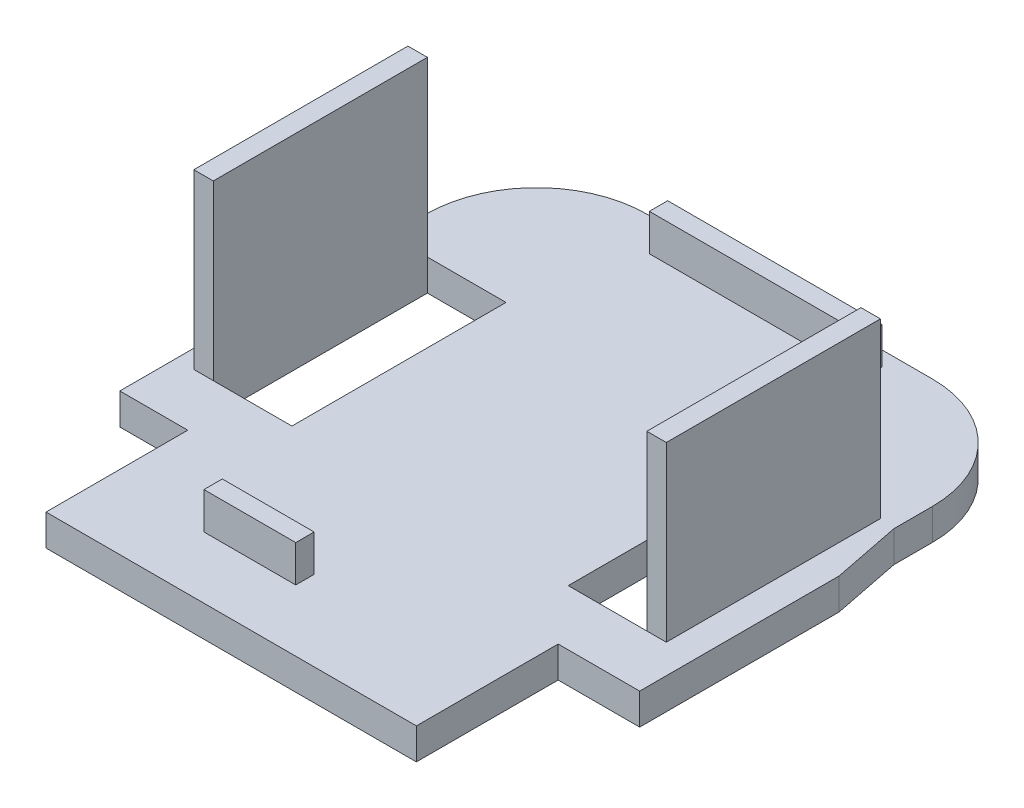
ISO-10303-21;
HEADER;
FILE_DESCRIPTION(('STEP AP214'),'2;1');
FILE_NAME('part.step','',(''),(''),'','','');
FILE_SCHEMA(('AUTOMOTIVE_DESIGN { 1 0 10303 214 1 1 1 1 }'));
ENDSEC;
DATA;
#1=APPLICATION_CONTEXT('core data for automotive mechanical design processes');
#2=APPLICATION_PROTOCOL_DEFINITION('international standard','automotive_design',2000,#1);
#3=PRODUCT_CONTEXT('',#1,'mechanical');
#4=PRODUCT('Part','Part','',(#3));
#5=PRODUCT_RELATED_PRODUCT_CATEGORY('part','',(#4));
#6=PRODUCT_DEFINITION_FORMATION('','',#4);
#7=PRODUCT_DEFINITION_CONTEXT('part definition',#1,'design');
#8=PRODUCT_DEFINITION('design','',#6,#7);
#9=PRODUCT_DEFINITION_SHAPE('','',#8);
#10=(LENGTH_UNIT() NAMED_UNIT(*) SI_UNIT(.MILLI.,.METRE.));
#11=(NAMED_UNIT(*) PLANE_ANGLE_UNIT() SI_UNIT($,.RADIAN.));
#12=(NAMED_UNIT(*) SI_UNIT($,.STERADIAN.) SOLID_ANGLE_UNIT());
#13=UNCERTAINTY_MEASURE_WITH_UNIT(LENGTH_MEASURE(1.E-05),#10,'distance_accuracy_value','');
#14=(GEOMETRIC_REPRESENTATION_CONTEXT(3) GLOBAL_UNCERTAINTY_ASSIGNED_CONTEXT((#13)) GLOBAL_UNIT_ASSIGNED_CONTEXT((#10,
#11,#12)) REPRESENTATION_CONTEXT('',''));
#15=CARTESIAN_POINT('',(0.,0.,0.));
#16=DIRECTION('',(0.,0.,1.));
#17=DIRECTION('',(1.,0.,0.));
#18=AXIS2_PLACEMENT_3D('',#15,#16,#17);
#19=CARTESIAN_POINT('',(22.6949,2.159,-31.0007));
#20=DIRECTION('',(0.,1.,0.));
#21=DIRECTION('',(0.,0.,1.));
#22=AXIS2_PLACEMENT_3D('',#19,#20,#21);
#23=PLANE('',#22);
#24=DIRECTION('',(1.,0.,0.));
#25=VECTOR('',#24,1.);
#26=CARTESIAN_POINT('',(27.9019,2.159,-13.6525));
#27=LINE('',#26,#25);
#28=CARTESIAN_POINT('',(22.4663,2.159,-13.6525));
#29=VERTEX_POINT('',#28);
#30=CARTESIAN_POINT('',(27.9019,2.159,-13.6525));
#31=VERTEX_POINT('',#30);
#32=EDGE_CURVE('E278',#29,#31,#27,.T.);
#33=ORIENTED_EDGE('',*,*,#32,.F.);
#34=DIRECTION('',(0.,0.,1.));
#35=VECTOR('',#34,1.);
#36=CARTESIAN_POINT('',(22.4663,2.159,-28.4607));
#37=LINE('',#36,#35);
#38=CARTESIAN_POINT('',(22.4663,2.159,-28.4607));
#39=VERTEX_POINT('',#38);
#40=EDGE_CURVE('E280',#39,#29,#37,.T.);
#41=ORIENTED_EDGE('',*,*,#40,.F.);
#42=DIRECTION('',(-1.,0.,0.));
#43=VECTOR('',#42,1.);
#44=CARTESIAN_POINT('',(27.9019,2.159,-28.4607));
#45=LINE('',#44,#43);
#46=CARTESIAN_POINT('',(27.9019,2.159,-28.4607));
#47=VERTEX_POINT('',#46);
#48=EDGE_CURVE('E285',#47,#39,#45,.T.);
#49=ORIENTED_EDGE('',*,*,#48,.F.);
#50=DIRECTION('',(-1.,0.,0.));
#51=VECTOR('',#50,1.);
#52=CARTESIAN_POINT('',(27.9019,2.159,-28.4607));
#53=LINE('',#52,#51);
#54=CARTESIAN_POINT('',(29.2481,2.159,-28.4607));
#55=VERTEX_POINT('',#54);
#56=EDGE_CURVE('E326',#55,#47,#53,.T.);
#57=ORIENTED_EDGE('',*,*,#56,.F.);
#58=DIRECTION('',(0.,0.,-1.));
#59=VECTOR('',#58,1.);
#60=CARTESIAN_POINT('',(29.2481,2.159,-13.6525));
#61=LINE('',#60,#59);
#62=CARTESIAN_POINT('',(29.2481,2.159,-13.6525));
#63=VERTEX_POINT('',#62);
#64=EDGE_CURVE('E333',#63,#55,#61,.T.);
#65=ORIENTED_EDGE('',*,*,#64,.F.);
#66=DIRECTION('',(1.,0.,0.));
#67=VECTOR('',#66,1.);
#68=CARTESIAN_POINT('',(27.9019,2.159,-13.6525));
#69=LINE('',#68,#67);
#70=EDGE_CURVE('E316',#31,#63,#69,.T.);
#71=ORIENTED_EDGE('',*,*,#70,.F.);
#72=EDGE_LOOP('',(#33,#41,#49,#57,#65,#71));
#73=FACE_BOUND('',#72,.T.);
#74=DIRECTION('',(-1.,0.,0.));
#75=VECTOR('',#74,1.);
#76=CARTESIAN_POINT('',(-2.0828,2.159,-28.4607));
#77=LINE('',#76,#75);
#78=CARTESIAN_POINT('',(3.3528,2.159,-28.4607));
#79=VERTEX_POINT('',#78);
#80=CARTESIAN_POINT('',(-2.0828,2.159,-28.4607));
#81=VERTEX_POINT('',#80);
#82=EDGE_CURVE('E299',#79,#81,#77,.T.);
#83=ORIENTED_EDGE('',*,*,#82,.F.);
#84=DIRECTION('',(0.,0.,-1.));
#85=VECTOR('',#84,1.);
#86=CARTESIAN_POINT('',(3.3528,2.159,-28.4607));
#87=LINE('',#86,#85);
#88=CARTESIAN_POINT('',(3.3528,2.159,-13.6525));
#89=VERTEX_POINT('',#88);
#90=EDGE_CURVE('E309',#89,#79,#87,.T.);
#91=ORIENTED_EDGE('',*,*,#90,.F.);
#92=DIRECTION('',(1.,0.,0.));
#93=VECTOR('',#92,1.);
#94=CARTESIAN_POINT('',(-2.0828,2.159,-13.6525));
#95=LINE('',#94,#93);
#96=CARTESIAN_POINT('',(-2.0828,2.159,-13.6525));
#97=VERTEX_POINT('',#96);
#98=EDGE_CURVE('E291',#97,#89,#95,.T.);
#99=ORIENTED_EDGE('',*,*,#98,.F.);
#100=DIRECTION('',(1.,0.,0.));
#101=VECTOR('',#100,1.);
#102=CARTESIAN_POINT('',(-3.429,2.159,-13.6525));
#103=LINE('',#102,#101);
#104=CARTESIAN_POINT('',(-3.429,2.159,-13.6525));
#105=VERTEX_POINT('',#104);
#106=EDGE_CURVE('E361',#105,#97,#103,.T.);
#107=ORIENTED_EDGE('',*,*,#106,.F.);
#108=DIRECTION('',(0.,0.,1.));
#109=VECTOR('',#108,1.);
#110=CARTESIAN_POINT('',(-3.429,2.159,-28.4607));
#111=LINE('',#110,#109);
#112=CARTESIAN_POINT('',(-3.429,2.159,-28.4607));
#113=VERTEX_POINT('',#112);
#114=EDGE_CURVE('E347',#113,#105,#111,.T.);
#115=ORIENTED_EDGE('',*,*,#114,.F.);
#116=DIRECTION('',(-1.,0.,0.));
#117=VECTOR('',#116,1.);
#118=CARTESIAN_POINT('',(-3.429,2.159,-28.4607));
#119=LINE('',#118,#117);
#120=EDGE_CURVE('E352',#81,#113,#119,.T.);
#121=ORIENTED_EDGE('',*,*,#120,.F.);
#122=EDGE_LOOP('',(#83,#91,#99,#107,#115,#121));
#123=FACE_BOUND('',#122,.T.);
#124=DIRECTION('',(1.,0.,0.));
#125=VECTOR('',#124,1.);
#126=CARTESIAN_POINT('',(0.,2.159,0.));
#127=LINE('',#126,#125);
#128=CARTESIAN_POINT('',(0.,2.159,0.));
#129=VERTEX_POINT('',#128);
#130=CARTESIAN_POINT('',(25.6159,2.159,0.));
#131=VERTEX_POINT('',#130);
#132=EDGE_CURVE('E434',#129,#131,#127,.T.);
#133=ORIENTED_EDGE('',*,*,#132,.T.);
#134=DIRECTION('',(0.,0.,-1.));
#135=VECTOR('',#134,1.);
#136=CARTESIAN_POINT('',(25.6159,2.159,0.));
#137=LINE('',#136,#135);
#138=CARTESIAN_POINT('',(25.6159,2.159,-9.8044));
#139=VERTEX_POINT('',#138);
#140=EDGE_CURVE('E437',#131,#139,#137,.T.);
#141=ORIENTED_EDGE('',*,*,#140,.T.);
#142=DIRECTION('',(1.,0.,0.));
#143=VECTOR('',#142,1.);
#144=CARTESIAN_POINT('',(25.6159,2.159,-9.8044));
#145=LINE('',#144,#143);
#146=CARTESIAN_POINT('',(31.2547,2.159,-9.8044));
#147=VERTEX_POINT('',#146);
#148=EDGE_CURVE('E440',#139,#147,#145,.T.);
#149=ORIENTED_EDGE('',*,*,#148,.T.);
#150=DIRECTION('',(0.,0.,-1.));
#151=VECTOR('',#150,1.);
#152=CARTESIAN_POINT('',(31.2547,2.159,-23.5966));
#153=LINE('',#152,#151);
#154=CARTESIAN_POINT('',(31.2547,2.159,-23.5966));
#155=VERTEX_POINT('',#154);
#156=EDGE_CURVE('E442',#147,#155,#153,.T.);
#157=ORIENTED_EDGE('',*,*,#156,.T.);
#158=DIRECTION('',(-0.194736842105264,0.,-0.980855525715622));
#159=VECTOR('',#158,1.);
#160=CARTESIAN_POINT('',(30.3149,2.159,-28.3302087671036));
#161=LINE('',#160,#159);
#162=CARTESIAN_POINT('',(30.3149,2.159,-28.3302087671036));
#163=VERTEX_POINT('',#162);
#164=EDGE_CURVE('E444',#155,#163,#161,.T.);
#165=ORIENTED_EDGE('',*,*,#164,.T.);
#166=DIRECTION('',(0.,0.,-1.));
#167=VECTOR('',#166,1.);
#168=CARTESIAN_POINT('',(30.3149,2.159,-31.0007));
#169=LINE('',#168,#167);
#170=CARTESIAN_POINT('',(30.3149,2.159,-31.0007));
#171=VERTEX_POINT('',#170);
#172=EDGE_CURVE('E446',#163,#171,#169,.T.);
#173=ORIENTED_EDGE('',*,*,#172,.T.);
#174=CARTESIAN_POINT('',(22.6949,2.159,-31.0007));
#175=DIRECTION('',(0.,1.,0.));
#176=DIRECTION('',(0.,0.,1.));
#177=AXIS2_PLACEMENT_3D('',#174,#175,#176);
#178=CIRCLE('',#177,7.61999999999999);
#179=CARTESIAN_POINT('',(22.6949,2.159,-38.6207));
#180=VERTEX_POINT('',#179);
#181=EDGE_CURVE('E448',#171,#180,#178,.T.);
#182=ORIENTED_EDGE('',*,*,#181,.T.);
#183=DIRECTION('',(-1.,0.,0.));
#184=VECTOR('',#183,1.);
#185=CARTESIAN_POINT('',(2.92100000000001,2.159,-38.6207));
#186=LINE('',#185,#184);
#187=CARTESIAN_POINT('',(2.92100000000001,2.159,-38.6207));
#188=VERTEX_POINT('',#187);
#189=EDGE_CURVE('E450',#180,#188,#186,.T.);
#190=ORIENTED_EDGE('',*,*,#189,.T.);
#191=CARTESIAN_POINT('',(2.92100000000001,2.159,-31.0007));
#192=DIRECTION('',(0.,1.,0.));
#193=DIRECTION('',(0.,0.,-1.));
#194=AXIS2_PLACEMENT_3D('',#191,#192,#193);
#195=CIRCLE('',#194,7.62);
#196=CARTESIAN_POINT('',(-4.699,2.159,-31.0007));
#197=VERTEX_POINT('',#196);
#198=EDGE_CURVE('E452',#188,#197,#195,.T.);
#199=ORIENTED_EDGE('',*,*,#198,.T.);
#200=DIRECTION('',(0.,0.,1.));
#201=VECTOR('',#200,1.);
#202=CARTESIAN_POINT('',(-4.699,2.159,-9.8044));
#203=LINE('',#202,#201);
#204=CARTESIAN_POINT('',(-4.699,2.159,-9.8044));
#205=VERTEX_POINT('',#204);
#206=EDGE_CURVE('E454',#197,#205,#203,.T.);
#207=ORIENTED_EDGE('',*,*,#206,.T.);
#208=DIRECTION('',(1.,0.,0.));
#209=VECTOR('',#208,1.);
#210=CARTESIAN_POINT('',(0.,2.159,-9.8044));
#211=LINE('',#210,#209);
#212=CARTESIAN_POINT('',(0.,2.159,-9.8044));
#213=VERTEX_POINT('',#212);
#214=EDGE_CURVE('E456',#205,#213,#211,.T.);
#215=ORIENTED_EDGE('',*,*,#214,.T.);
#216=DIRECTION('',(0.,0.,1.));
#217=VECTOR('',#216,1.);
#218=CARTESIAN_POINT('',(0.,2.159,0.));
#219=LINE('',#218,#217);
#220=EDGE_CURVE('E458',#213,#129,#219,.T.);
#221=ORIENTED_EDGE('',*,*,#220,.T.);
#222=EDGE_LOOP('',(#133,#141,#149,#157,#165,#173,#182,#190,#199,#207,#215,#221));
#223=FACE_BOUND('',#222,.T.);
#224=DIRECTION('',(1.,0.,0.));
#225=VECTOR('',#224,1.);
#226=CARTESIAN_POINT('',(5.39115,2.159,-36.3347));
#227=LINE('',#226,#225);
#228=CARTESIAN_POINT('',(5.39115,2.159,-36.3347));
#229=VERTEX_POINT('',#228);
#230=CARTESIAN_POINT('',(20.22475,2.159,-36.3347));
#231=VERTEX_POINT('',#230);
#232=EDGE_CURVE('E418',#229,#231,#227,.T.);
#233=ORIENTED_EDGE('',*,*,#232,.F.);
#234=DIRECTION('',(0.,0.,1.));
#235=VECTOR('',#234,1.);
#236=CARTESIAN_POINT('',(5.39115,2.159,-36.3347));
#237=LINE('',#236,#235);
#238=CARTESIAN_POINT('',(5.39115,2.159,-37.6047));
#239=VERTEX_POINT('',#238);
#240=EDGE_CURVE('E404',#239,#229,#237,.T.);
#241=ORIENTED_EDGE('',*,*,#240,.F.);
#242=DIRECTION('',(-1.,0.,0.));
#243=VECTOR('',#242,1.);
#244=CARTESIAN_POINT('',(5.39115,2.159,-37.6047));
#245=LINE('',#244,#243);
#246=CARTESIAN_POINT('',(20.22475,2.159,-37.6047));
#247=VERTEX_POINT('',#246);
#248=EDGE_CURVE('E409',#247,#239,#245,.T.);
#249=ORIENTED_EDGE('',*,*,#248,.F.);
#250=DIRECTION('',(0.,0.,-1.));
#251=VECTOR('',#250,1.);
#252=CARTESIAN_POINT('',(20.22475,2.159,-36.3347));
#253=LINE('',#252,#251);
#254=EDGE_CURVE('E420',#231,#247,#253,.T.);
#255=ORIENTED_EDGE('',*,*,#254,.F.);
#256=EDGE_LOOP('',(#233,#241,#249,#255));
#257=FACE_BOUND('',#256,.T.);
#258=DIRECTION('',(1.,0.,0.));
#259=VECTOR('',#258,1.);
#260=CARTESIAN_POINT('',(6.6548,2.159,-4.2672));
#261=LINE('',#260,#259);
#262=CARTESIAN_POINT('',(6.6548,2.159,-4.2672));
#263=VERTEX_POINT('',#262);
#264=CARTESIAN_POINT('',(13.0048,2.159,-4.2672));
#265=VERTEX_POINT('',#264);
#266=EDGE_CURVE('E389',#263,#265,#261,.T.);
#267=ORIENTED_EDGE('',*,*,#266,.F.);
#268=DIRECTION('',(0.,0.,1.));
#269=VECTOR('',#268,1.);
#270=CARTESIAN_POINT('',(6.6548,2.159,-4.2672));
#271=LINE('',#270,#269);
#272=CARTESIAN_POINT('',(6.6548,2.159,-5.5372));
#273=VERTEX_POINT('',#272);
#274=EDGE_CURVE('E375',#273,#263,#271,.T.);
#275=ORIENTED_EDGE('',*,*,#274,.F.);
#276=DIRECTION('',(-1.,0.,0.));
#277=VECTOR('',#276,1.);
#278=CARTESIAN_POINT('',(6.6548,2.159,-5.5372));
#279=LINE('',#278,#277);
#280=CARTESIAN_POINT('',(13.0048,2.159,-5.5372));
#281=VERTEX_POINT('',#280);
#282=EDGE_CURVE('E380',#281,#273,#279,.T.);
#283=ORIENTED_EDGE('',*,*,#282,.F.);
#284=DIRECTION('',(0.,0.,-1.));
#285=VECTOR('',#284,1.);
#286=CARTESIAN_POINT('',(13.0048,2.159,-4.2672));
#287=LINE('',#286,#285);
#288=EDGE_CURVE('E391',#265,#281,#287,.T.);
#289=ORIENTED_EDGE('',*,*,#288,.F.);
#290=EDGE_LOOP('',(#267,#275,#283,#289));
#291=FACE_BOUND('',#290,.T.);
#292=ADVANCED_FACE('F33',(#73,#123,#223,#257,#291),#23,.T.);
#293=CARTESIAN_POINT('',(0.,2.159,0.));
#294=DIRECTION('',(0.,0.,-1.));
#295=DIRECTION('',(-1.,0.,0.));
#296=AXIS2_PLACEMENT_3D('',#293,#294,#295);
#297=PLANE('',#296);
#298=DIRECTION('',(1.,0.,0.));
#299=VECTOR('',#298,1.);
#300=CARTESIAN_POINT('',(0.,0.,0.));
#301=LINE('',#300,#299);
#302=CARTESIAN_POINT('',(0.,0.,0.));
#303=VERTEX_POINT('',#302);
#304=CARTESIAN_POINT('',(25.6159,0.,0.));
#305=VERTEX_POINT('',#304);
#306=EDGE_CURVE('E433',#303,#305,#301,.T.);
#307=ORIENTED_EDGE('',*,*,#306,.T.);
#308=DIRECTION('',(0.,-1.,0.));
#309=VECTOR('',#308,1.);
#310=CARTESIAN_POINT('',(25.6159,2.159,0.));
#311=LINE('',#310,#309);
#312=EDGE_CURVE('E11',#131,#305,#311,.T.);
#313=ORIENTED_EDGE('',*,*,#312,.F.);
#314=ORIENTED_EDGE('',*,*,#132,.F.);
#315=DIRECTION('',(0.,-1.,0.));
#316=VECTOR('',#315,1.);
#317=CARTESIAN_POINT('',(0.,2.159,0.));
#318=LINE('',#317,#316);
#319=EDGE_CURVE('E460',#129,#303,#318,.T.);
#320=ORIENTED_EDGE('',*,*,#319,.T.);
#321=EDGE_LOOP('',(#307,#313,#314,#320));
#322=FACE_BOUND('',#321,.T.);
#323=ADVANCED_FACE('F35',(#322),#297,.F.);
#324=CARTESIAN_POINT('',(25.6159,2.159,0.));
#325=DIRECTION('',(-1.,0.,0.));
#326=DIRECTION('',(0.,0.,1.));
#327=AXIS2_PLACEMENT_3D('',#324,#325,#326);
#328=PLANE('',#327);
#329=DIRECTION('',(0.,0.,-1.));
#330=VECTOR('',#329,1.);
#331=CARTESIAN_POINT('',(25.6159,0.,0.));
#332=LINE('',#331,#330);
#333=CARTESIAN_POINT('',(25.6159,0.,-9.8044));
#334=VERTEX_POINT('',#333);
#335=EDGE_CURVE('E463',#305,#334,#332,.T.);
#336=ORIENTED_EDGE('',*,*,#335,.T.);
#337=DIRECTION('',(0.,-1.,0.));
#338=VECTOR('',#337,1.);
#339=CARTESIAN_POINT('',(25.6159,2.159,-9.8044));
#340=LINE('',#339,#338);
#341=EDGE_CURVE('E41',#139,#334,#340,.T.);
#342=ORIENTED_EDGE('',*,*,#341,.F.);
#343=ORIENTED_EDGE('',*,*,#140,.F.);
#344=ORIENTED_EDGE('',*,*,#312,.T.);
#345=EDGE_LOOP('',(#336,#342,#343,#344));
#346=FACE_BOUND('',#345,.T.);
#347=ADVANCED_FACE('F539',(#346),#328,.F.);
#348=CARTESIAN_POINT('',(25.6159,2.159,-9.8044));
#349=DIRECTION('',(0.,0.,-1.));
#350=DIRECTION('',(-1.,0.,0.));
#351=AXIS2_PLACEMENT_3D('',#348,#349,#350);
#352=PLANE('',#351);
#353=DIRECTION('',(1.,0.,0.));
#354=VECTOR('',#353,1.);
#355=CARTESIAN_POINT('',(25.6159,0.,-9.8044));
#356=LINE('',#355,#354);
#357=CARTESIAN_POINT('',(31.2547,0.,-9.8044));
#358=VERTEX_POINT('',#357);
#359=EDGE_CURVE('E465',#334,#358,#356,.T.);
#360=ORIENTED_EDGE('',*,*,#359,.T.);
#361=DIRECTION('',(0.,-1.,0.));
#362=VECTOR('',#361,1.);
#363=CARTESIAN_POINT('',(31.2547,2.159,-9.8044));
#364=LINE('',#363,#362);
#365=EDGE_CURVE('E510',#147,#358,#364,.T.);
#366=ORIENTED_EDGE('',*,*,#365,.F.);
#367=ORIENTED_EDGE('',*,*,#148,.F.);
#368=ORIENTED_EDGE('',*,*,#341,.T.);
#369=EDGE_LOOP('',(#360,#366,#367,#368));
#370=FACE_BOUND('',#369,.T.);
#371=ADVANCED_FACE('F517',(#370),#352,.F.);
#372=CARTESIAN_POINT('',(31.2547,2.159,-23.5966));
#373=DIRECTION('',(-1.,0.,0.));
#374=DIRECTION('',(0.,0.,1.));
#375=AXIS2_PLACEMENT_3D('',#372,#373,#374);
#376=PLANE('',#375);
#377=DIRECTION('',(0.,0.,-1.));
#378=VECTOR('',#377,1.);
#379=CARTESIAN_POINT('',(31.2547,0.,-23.5966));
#380=LINE('',#379,#378);
#381=CARTESIAN_POINT('',(31.2547,0.,-23.5966));
#382=VERTEX_POINT('',#381);
#383=EDGE_CURVE('E467',#358,#382,#380,.T.);
#384=ORIENTED_EDGE('',*,*,#383,.T.);
#385=DIRECTION('',(0.,-1.,0.));
#386=VECTOR('',#385,1.);
#387=CARTESIAN_POINT('',(31.2547,2.159,-23.5966));
#388=LINE('',#387,#386);
#389=EDGE_CURVE('E507',#155,#382,#388,.T.);
#390=ORIENTED_EDGE('',*,*,#389,.F.);
#391=ORIENTED_EDGE('',*,*,#156,.F.);
#392=ORIENTED_EDGE('',*,*,#365,.T.);
#393=EDGE_LOOP('',(#384,#390,#391,#392));
#394=FACE_BOUND('',#393,.T.);
#395=ADVANCED_FACE('F527',(#394),#376,.F.);
#396=CARTESIAN_POINT('',(30.3149,2.159,-28.3302087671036));
#397=DIRECTION('',(-0.980855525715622,0.,0.194736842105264));
#398=DIRECTION('',(0.194736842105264,0.,0.980855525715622));
#399=AXIS2_PLACEMENT_3D('',#396,#397,#398);
#400=PLANE('',#399);
#401=DIRECTION('',(-0.194736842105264,0.,-0.980855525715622));
#402=VECTOR('',#401,1.);
#403=CARTESIAN_POINT('',(30.3149,0.,-28.3302087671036));
#404=LINE('',#403,#402);
#405=CARTESIAN_POINT('',(30.3149,0.,-28.3302087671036));
#406=VERTEX_POINT('',#405);
#407=EDGE_CURVE('E469',#382,#406,#404,.T.);
#408=ORIENTED_EDGE('',*,*,#407,.T.);
#409=DIRECTION('',(0.,-1.,0.));
#410=VECTOR('',#409,1.);
#411=CARTESIAN_POINT('',(30.3149,2.159,-28.3302087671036));
#412=LINE('',#411,#410);
#413=EDGE_CURVE('E504',#163,#406,#412,.T.);
#414=ORIENTED_EDGE('',*,*,#413,.F.);
#415=ORIENTED_EDGE('',*,*,#164,.F.);
#416=ORIENTED_EDGE('',*,*,#389,.T.);
#417=EDGE_LOOP('',(#408,#414,#415,#416));
#418=FACE_BOUND('',#417,.T.);
#419=ADVANCED_FACE('F531',(#418),#400,.F.);
#420=CARTESIAN_POINT('',(30.3149,2.159,-31.0007));
#421=DIRECTION('',(-1.,0.,0.));
#422=DIRECTION('',(0.,0.,1.));
#423=AXIS2_PLACEMENT_3D('',#420,#421,#422);
#424=PLANE('',#423);
#425=DIRECTION('',(0.,0.,-1.));
#426=VECTOR('',#425,1.);
#427=CARTESIAN_POINT('',(30.3149,0.,-31.0007));
#428=LINE('',#427,#426);
#429=CARTESIAN_POINT('',(30.3149,0.,-31.0007));
#430=VERTEX_POINT('',#429);
#431=EDGE_CURVE('E471',#406,#430,#428,.T.);
#432=ORIENTED_EDGE('',*,*,#431,.T.);
#433=DIRECTION('',(0.,-1.,0.));
#434=VECTOR('',#433,1.);
#435=CARTESIAN_POINT('',(30.3149,2.159,-31.0007));
#436=LINE('',#435,#434);
#437=EDGE_CURVE('E501',#171,#430,#436,.T.);
#438=ORIENTED_EDGE('',*,*,#437,.F.);
#439=ORIENTED_EDGE('',*,*,#172,.F.);
#440=ORIENTED_EDGE('',*,*,#413,.T.);
#441=EDGE_LOOP('',(#432,#438,#439,#440));
#442=FACE_BOUND('',#441,.T.);
#443=ADVANCED_FACE('F572',(#442),#424,.F.);
#444=CARTESIAN_POINT('',(22.6949,2.159,-31.0007));
#445=DIRECTION('',(0.,-1.,0.));
#446=DIRECTION('',(0.,0.,-1.));
#447=AXIS2_PLACEMENT_3D('',#444,#445,#446);
#448=CYLINDRICAL_SURFACE('',#447,7.61999999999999);
#449=CARTESIAN_POINT('',(22.6949,0.,-31.0007));
#450=DIRECTION('',(0.,1.,0.));
#451=DIRECTION('',(0.,0.,1.));
#452=AXIS2_PLACEMENT_3D('',#449,#450,#451);
#453=CIRCLE('',#452,7.61999999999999);
#454=CARTESIAN_POINT('',(22.6949,0.,-38.6207));
#455=VERTEX_POINT('',#454);
#456=EDGE_CURVE('E473',#430,#455,#453,.T.);
#457=ORIENTED_EDGE('',*,*,#456,.T.);
#458=DIRECTION('',(0.,-1.,0.));
#459=VECTOR('',#458,1.);
#460=CARTESIAN_POINT('',(22.6949,2.159,-38.6207));
#461=LINE('',#460,#459);
#462=EDGE_CURVE('E498',#180,#455,#461,.T.);
#463=ORIENTED_EDGE('',*,*,#462,.F.);
#464=ORIENTED_EDGE('',*,*,#181,.F.);
#465=ORIENTED_EDGE('',*,*,#437,.T.);
#466=EDGE_LOOP('',(#457,#463,#464,#465));
#467=FACE_BOUND('',#466,.T.);
#468=ADVANCED_FACE('F570',(#467),#448,.T.);
#469=CARTESIAN_POINT('',(2.92100000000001,2.159,-38.6207));
#470=DIRECTION('',(0.,0.,1.));
#471=DIRECTION('',(1.,0.,0.));
#472=AXIS2_PLACEMENT_3D('',#469,#470,#471);
#473=PLANE('',#472);
#474=DIRECTION('',(-1.,0.,0.));
#475=VECTOR('',#474,1.);
#476=CARTESIAN_POINT('',(2.92100000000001,0.,-38.6207));
#477=LINE('',#476,#475);
#478=CARTESIAN_POINT('',(2.92100000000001,0.,-38.6207));
#479=VERTEX_POINT('',#478);
#480=EDGE_CURVE('E475',#455,#479,#477,.T.);
#481=ORIENTED_EDGE('',*,*,#480,.T.);
#482=DIRECTION('',(0.,-1.,0.));
#483=VECTOR('',#482,1.);
#484=CARTESIAN_POINT('',(2.92100000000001,2.159,-38.6207));
#485=LINE('',#484,#483);
#486=EDGE_CURVE('E495',#188,#479,#485,.T.);
#487=ORIENTED_EDGE('',*,*,#486,.F.);
#488=ORIENTED_EDGE('',*,*,#189,.F.);
#489=ORIENTED_EDGE('',*,*,#462,.T.);
#490=EDGE_LOOP('',(#481,#487,#488,#489));
#491=FACE_BOUND('',#490,.T.);
#492=ADVANCED_FACE('F566',(#491),#473,.F.);
#493=CARTESIAN_POINT('',(2.92100000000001,2.159,-31.0007));
#494=DIRECTION('',(0.,-1.,0.));
#495=DIRECTION('',(0.,0.,-1.));
#496=AXIS2_PLACEMENT_3D('',#493,#494,#495);
#497=CYLINDRICAL_SURFACE('',#496,7.62);
#498=CARTESIAN_POINT('',(2.92100000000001,0.,-31.0007));
#499=DIRECTION('',(0.,1.,0.));
#500=DIRECTION('',(0.,0.,-1.));
#501=AXIS2_PLACEMENT_3D('',#498,#499,#500);
#502=CIRCLE('',#501,7.62);
#503=CARTESIAN_POINT('',(-4.699,0.,-31.0007));
#504=VERTEX_POINT('',#503);
#505=EDGE_CURVE('E477',#479,#504,#502,.T.);
#506=ORIENTED_EDGE('',*,*,#505,.T.);
#507=DIRECTION('',(0.,-1.,0.));
#508=VECTOR('',#507,1.);
#509=CARTESIAN_POINT('',(-4.699,2.159,-31.0007));
#510=LINE('',#509,#508);
#511=EDGE_CURVE('E492',#197,#504,#510,.T.);
#512=ORIENTED_EDGE('',*,*,#511,.F.);
#513=ORIENTED_EDGE('',*,*,#198,.F.);
#514=ORIENTED_EDGE('',*,*,#486,.T.);
#515=EDGE_LOOP('',(#506,#512,#513,#514));
#516=FACE_BOUND('',#515,.T.);
#517=ADVANCED_FACE('F561',(#516),#497,.T.);
#518=CARTESIAN_POINT('',(-4.699,2.159,-9.8044));
#519=DIRECTION('',(1.,0.,0.));
#520=DIRECTION('',(0.,0.,-1.));
#521=AXIS2_PLACEMENT_3D('',#518,#519,#520);
#522=PLANE('',#521);
#523=DIRECTION('',(0.,0.,1.));
#524=VECTOR('',#523,1.);
#525=CARTESIAN_POINT('',(-4.699,0.,-9.8044));
#526=LINE('',#525,#524);
#527=CARTESIAN_POINT('',(-4.699,0.,-9.8044));
#528=VERTEX_POINT('',#527);
#529=EDGE_CURVE('E479',#504,#528,#526,.T.);
#530=ORIENTED_EDGE('',*,*,#529,.T.);
#531=DIRECTION('',(0.,-1.,0.));
#532=VECTOR('',#531,1.);
#533=CARTESIAN_POINT('',(-4.699,2.159,-9.8044));
#534=LINE('',#533,#532);
#535=EDGE_CURVE('E489',#205,#528,#534,.T.);
#536=ORIENTED_EDGE('',*,*,#535,.F.);
#537=ORIENTED_EDGE('',*,*,#206,.F.);
#538=ORIENTED_EDGE('',*,*,#511,.T.);
#539=EDGE_LOOP('',(#530,#536,#537,#538));
#540=FACE_BOUND('',#539,.T.);
#541=ADVANCED_FACE('F555',(#540),#522,.F.);
#542=CARTESIAN_POINT('',(0.,2.159,-9.8044));
#543=DIRECTION('',(0.,0.,-1.));
#544=DIRECTION('',(-1.,0.,0.));
#545=AXIS2_PLACEMENT_3D('',#542,#543,#544);
#546=PLANE('',#545);
#547=DIRECTION('',(1.,0.,0.));
#548=VECTOR('',#547,1.);
#549=CARTESIAN_POINT('',(0.,0.,-9.8044));
#550=LINE('',#549,#548);
#551=CARTESIAN_POINT('',(0.,0.,-9.8044));
#552=VERTEX_POINT('',#551);
#553=EDGE_CURVE('E481',#528,#552,#550,.T.);
#554=ORIENTED_EDGE('',*,*,#553,.T.);
#555=DIRECTION('',(0.,-1.,0.));
#556=VECTOR('',#555,1.);
#557=CARTESIAN_POINT('',(0.,2.159,-9.8044));
#558=LINE('',#557,#556);
#559=EDGE_CURVE('E486',#213,#552,#558,.T.);
#560=ORIENTED_EDGE('',*,*,#559,.F.);
#561=ORIENTED_EDGE('',*,*,#214,.F.);
#562=ORIENTED_EDGE('',*,*,#535,.T.);
#563=EDGE_LOOP('',(#554,#560,#561,#562));
#564=FACE_BOUND('',#563,.T.);
#565=ADVANCED_FACE('F551',(#564),#546,.F.);
#566=CARTESIAN_POINT('',(0.,2.159,0.));
#567=DIRECTION('',(1.,0.,0.));
#568=DIRECTION('',(0.,0.,-1.));
#569=AXIS2_PLACEMENT_3D('',#566,#567,#568);
#570=PLANE('',#569);
#571=DIRECTION('',(0.,0.,1.));
#572=VECTOR('',#571,1.);
#573=CARTESIAN_POINT('',(0.,0.,0.));
#574=LINE('',#573,#572);
#575=EDGE_CURVE('E438',#552,#303,#574,.T.);
#576=ORIENTED_EDGE('',*,*,#575,.T.);
#577=ORIENTED_EDGE('',*,*,#319,.F.);
#578=ORIENTED_EDGE('',*,*,#220,.F.);
#579=ORIENTED_EDGE('',*,*,#559,.T.);
#580=EDGE_LOOP('',(#576,#577,#578,#579));
#581=FACE_BOUND('',#580,.T.);
#582=ADVANCED_FACE('F546',(#581),#570,.F.);
#583=CARTESIAN_POINT('',(22.6949,0.,-31.0007));
#584=DIRECTION('',(0.,1.,0.));
#585=DIRECTION('',(0.,0.,1.));
#586=AXIS2_PLACEMENT_3D('',#583,#584,#585);
#587=PLANE('',#586);
#588=DIRECTION('',(1.,0.,0.));
#589=VECTOR('',#588,1.);
#590=CARTESIAN_POINT('',(27.9019,0.,-13.6525));
#591=LINE('',#590,#589);
#592=CARTESIAN_POINT('',(22.4663,0.,-13.6525));
#593=VERTEX_POINT('',#592);
#594=CARTESIAN_POINT('',(27.9019,0.,-13.6525));
#595=VERTEX_POINT('',#594);
#596=EDGE_CURVE('E268',#593,#595,#591,.T.);
#597=ORIENTED_EDGE('',*,*,#596,.T.);
#598=DIRECTION('',(0.,0.,-1.));
#599=VECTOR('',#598,1.);
#600=CARTESIAN_POINT('',(27.9019,0.,-28.4607));
#601=LINE('',#600,#599);
#602=CARTESIAN_POINT('',(27.9019,0.,-28.4607));
#603=VERTEX_POINT('',#602);
#604=EDGE_CURVE('E259',#595,#603,#601,.T.);
#605=ORIENTED_EDGE('',*,*,#604,.T.);
#606=DIRECTION('',(-1.,0.,0.));
#607=VECTOR('',#606,1.);
#608=CARTESIAN_POINT('',(27.9019,0.,-28.4607));
#609=LINE('',#608,#607);
#610=CARTESIAN_POINT('',(22.4663,0.,-28.4607));
#611=VERTEX_POINT('',#610);
#612=EDGE_CURVE('E271',#603,#611,#609,.T.);
#613=ORIENTED_EDGE('',*,*,#612,.T.);
#614=DIRECTION('',(0.,0.,1.));
#615=VECTOR('',#614,1.);
#616=CARTESIAN_POINT('',(22.4663,0.,-28.4607));
#617=LINE('',#616,#615);
#618=EDGE_CURVE('E48',#611,#593,#617,.T.);
#619=ORIENTED_EDGE('',*,*,#618,.T.);
#620=EDGE_LOOP('',(#597,#605,#613,#619));
#621=FACE_BOUND('',#620,.T.);
#622=DIRECTION('',(-1.,0.,0.));
#623=VECTOR('',#622,1.);
#624=CARTESIAN_POINT('',(-2.0828,0.,-28.4607));
#625=LINE('',#624,#623);
#626=CARTESIAN_POINT('',(3.3528,0.,-28.4607));
#627=VERTEX_POINT('',#626);
#628=CARTESIAN_POINT('',(-2.0828,0.,-28.4607));
#629=VERTEX_POINT('',#628);
#630=EDGE_CURVE('E303',#627,#629,#625,.T.);
#631=ORIENTED_EDGE('',*,*,#630,.T.);
#632=DIRECTION('',(0.,0.,1.));
#633=VECTOR('',#632,1.);
#634=CARTESIAN_POINT('',(-2.0828,0.,-28.4607));
#635=LINE('',#634,#633);
#636=CARTESIAN_POINT('',(-2.0828,0.,-13.6525));
#637=VERTEX_POINT('',#636);
#638=EDGE_CURVE('E295',#629,#637,#635,.T.);
#639=ORIENTED_EDGE('',*,*,#638,.T.);
#640=DIRECTION('',(1.,0.,0.));
#641=VECTOR('',#640,1.);
#642=CARTESIAN_POINT('',(-2.0828,0.,-13.6525));
#643=LINE('',#642,#641);
#644=CARTESIAN_POINT('',(3.3528,0.,-13.6525));
#645=VERTEX_POINT('',#644);
#646=EDGE_CURVE('E298',#637,#645,#643,.T.);
#647=ORIENTED_EDGE('',*,*,#646,.T.);
#648=DIRECTION('',(0.,0.,-1.));
#649=VECTOR('',#648,1.);
#650=CARTESIAN_POINT('',(3.3528,0.,-28.4607));
#651=LINE('',#650,#649);
#652=EDGE_CURVE('E56',#645,#627,#651,.T.);
#653=ORIENTED_EDGE('',*,*,#652,.T.);
#654=EDGE_LOOP('',(#631,#639,#647,#653));
#655=FACE_BOUND('',#654,.T.);
#656=ORIENTED_EDGE('',*,*,#306,.F.);
#657=ORIENTED_EDGE('',*,*,#575,.F.);
#658=ORIENTED_EDGE('',*,*,#553,.F.);
#659=ORIENTED_EDGE('',*,*,#529,.F.);
#660=ORIENTED_EDGE('',*,*,#505,.F.);
#661=ORIENTED_EDGE('',*,*,#480,.F.);
#662=ORIENTED_EDGE('',*,*,#456,.F.);
#663=ORIENTED_EDGE('',*,*,#431,.F.);
#664=ORIENTED_EDGE('',*,*,#407,.F.);
#665=ORIENTED_EDGE('',*,*,#383,.F.);
#666=ORIENTED_EDGE('',*,*,#359,.F.);
#667=ORIENTED_EDGE('',*,*,#335,.F.);
#668=EDGE_LOOP('',(#656,#657,#658,#659,#660,#661,#662,#663,#664,#665,#666,#667));
#669=FACE_BOUND('',#668,.T.);
#670=ADVANCED_FACE('F275',(#621,#655,#669),#587,.F.);
#671=CARTESIAN_POINT('',(5.39115,4.699,-36.3347));
#672=DIRECTION('',(1.,0.,0.));
#673=DIRECTION('',(0.,0.,-1.));
#674=AXIS2_PLACEMENT_3D('',#671,#672,#673);
#675=PLANE('',#674);
#676=ORIENTED_EDGE('',*,*,#240,.T.);
#677=DIRECTION('',(0.,-1.,0.));
#678=VECTOR('',#677,1.);
#679=CARTESIAN_POINT('',(5.39115,4.699,-36.3347));
#680=LINE('',#679,#678);
#681=CARTESIAN_POINT('',(5.39115,4.699,-36.3347));
#682=VERTEX_POINT('',#681);
#683=EDGE_CURVE('E431',#682,#229,#680,.T.);
#684=ORIENTED_EDGE('',*,*,#683,.F.);
#685=DIRECTION('',(0.,0.,1.));
#686=VECTOR('',#685,1.);
#687=CARTESIAN_POINT('',(5.39115,4.699,-36.3347));
#688=LINE('',#687,#686);
#689=CARTESIAN_POINT('',(5.39115,4.699,-37.6047));
#690=VERTEX_POINT('',#689);
#691=EDGE_CURVE('E405',#690,#682,#688,.T.);
#692=ORIENTED_EDGE('',*,*,#691,.F.);
#693=DIRECTION('',(0.,-1.,0.));
#694=VECTOR('',#693,1.);
#695=CARTESIAN_POINT('',(5.39115,4.699,-37.6047));
#696=LINE('',#695,#694);
#697=EDGE_CURVE('E415',#690,#239,#696,.T.);
#698=ORIENTED_EDGE('',*,*,#697,.T.);
#699=EDGE_LOOP('',(#676,#684,#692,#698));
#700=FACE_BOUND('',#699,.T.);
#701=ADVANCED_FACE('F591',(#700),#675,.F.);
#702=CARTESIAN_POINT('',(5.39115,4.699,-36.3347));
#703=DIRECTION('',(0.,0.,-1.));
#704=DIRECTION('',(-1.,0.,0.));
#705=AXIS2_PLACEMENT_3D('',#702,#703,#704);
#706=PLANE('',#705);
#707=ORIENTED_EDGE('',*,*,#232,.T.);
#708=DIRECTION('',(0.,-1.,0.));
#709=VECTOR('',#708,1.);
#710=CARTESIAN_POINT('',(20.22475,4.699,-36.3347));
#711=LINE('',#710,#709);
#712=CARTESIAN_POINT('',(20.22475,4.699,-36.3347));
#713=VERTEX_POINT('',#712);
#714=EDGE_CURVE('E428',#713,#231,#711,.T.);
#715=ORIENTED_EDGE('',*,*,#714,.F.);
#716=DIRECTION('',(1.,0.,0.));
#717=VECTOR('',#716,1.);
#718=CARTESIAN_POINT('',(5.39115,4.699,-36.3347));
#719=LINE('',#718,#717);
#720=EDGE_CURVE('E408',#682,#713,#719,.T.);
#721=ORIENTED_EDGE('',*,*,#720,.F.);
#722=ORIENTED_EDGE('',*,*,#683,.T.);
#723=EDGE_LOOP('',(#707,#715,#721,#722));
#724=FACE_BOUND('',#723,.T.);
#725=ADVANCED_FACE('F635',(#724),#706,.F.);
#726=CARTESIAN_POINT('',(20.22475,4.699,-36.3347));
#727=DIRECTION('',(-1.,0.,0.));
#728=DIRECTION('',(0.,0.,1.));
#729=AXIS2_PLACEMENT_3D('',#726,#727,#728);
#730=PLANE('',#729);
#731=ORIENTED_EDGE('',*,*,#254,.T.);
#732=DIRECTION('',(0.,-1.,0.));
#733=VECTOR('',#732,1.);
#734=CARTESIAN_POINT('',(20.22475,4.699,-37.6047));
#735=LINE('',#734,#733);
#736=CARTESIAN_POINT('',(20.22475,4.699,-37.6047));
#737=VERTEX_POINT('',#736);
#738=EDGE_CURVE('E426',#737,#247,#735,.T.);
#739=ORIENTED_EDGE('',*,*,#738,.F.);
#740=DIRECTION('',(0.,0.,-1.));
#741=VECTOR('',#740,1.);
#742=CARTESIAN_POINT('',(20.22475,4.699,-36.3347));
#743=LINE('',#742,#741);
#744=EDGE_CURVE('E411',#713,#737,#743,.T.);
#745=ORIENTED_EDGE('',*,*,#744,.F.);
#746=ORIENTED_EDGE('',*,*,#714,.T.);
#747=EDGE_LOOP('',(#731,#739,#745,#746));
#748=FACE_BOUND('',#747,.T.);
#749=ADVANCED_FACE('F642',(#748),#730,.F.);
#750=CARTESIAN_POINT('',(5.39115,4.699,-37.6047));
#751=DIRECTION('',(0.,0.,1.));
#752=DIRECTION('',(1.,0.,0.));
#753=AXIS2_PLACEMENT_3D('',#750,#751,#752);
#754=PLANE('',#753);
#755=ORIENTED_EDGE('',*,*,#248,.T.);
#756=ORIENTED_EDGE('',*,*,#697,.F.);
#757=DIRECTION('',(-1.,0.,0.));
#758=VECTOR('',#757,1.);
#759=CARTESIAN_POINT('',(5.39115,4.699,-37.6047));
#760=LINE('',#759,#758);
#761=EDGE_CURVE('E413',#737,#690,#760,.T.);
#762=ORIENTED_EDGE('',*,*,#761,.F.);
#763=ORIENTED_EDGE('',*,*,#738,.T.);
#764=EDGE_LOOP('',(#755,#756,#762,#763));
#765=FACE_BOUND('',#764,.T.);
#766=ADVANCED_FACE('F649',(#765),#754,.F.);
#767=CARTESIAN_POINT('',(0.,4.699,0.));
#768=DIRECTION('',(0.,-1.,0.));
#769=DIRECTION('',(0.,0.,-1.));
#770=AXIS2_PLACEMENT_3D('',#767,#768,#769);
#771=PLANE('',#770);
#772=ORIENTED_EDGE('',*,*,#691,.T.);
#773=ORIENTED_EDGE('',*,*,#720,.T.);
#774=ORIENTED_EDGE('',*,*,#744,.T.);
#775=ORIENTED_EDGE('',*,*,#761,.T.);
#776=EDGE_LOOP('',(#772,#773,#774,#775));
#777=FACE_BOUND('',#776,.T.);
#778=ADVANCED_FACE('F657',(#777),#771,.F.);
#779=CARTESIAN_POINT('',(6.6548,4.699,-4.2672));
#780=DIRECTION('',(1.,0.,0.));
#781=DIRECTION('',(0.,0.,-1.));
#782=AXIS2_PLACEMENT_3D('',#779,#780,#781);
#783=PLANE('',#782);
#784=ORIENTED_EDGE('',*,*,#274,.T.);
#785=DIRECTION('',(0.,-1.,0.));
#786=VECTOR('',#785,1.);
#787=CARTESIAN_POINT('',(6.6548,4.699,-4.2672));
#788=LINE('',#787,#786);
#789=CARTESIAN_POINT('',(6.6548,4.699,-4.2672));
#790=VERTEX_POINT('',#789);
#791=EDGE_CURVE('E402',#790,#263,#788,.T.);
#792=ORIENTED_EDGE('',*,*,#791,.F.);
#793=DIRECTION('',(0.,0.,1.));
#794=VECTOR('',#793,1.);
#795=CARTESIAN_POINT('',(6.6548,4.699,-4.2672));
#796=LINE('',#795,#794);
#797=CARTESIAN_POINT('',(6.6548,4.699,-5.5372));
#798=VERTEX_POINT('',#797);
#799=EDGE_CURVE('E376',#798,#790,#796,.T.);
#800=ORIENTED_EDGE('',*,*,#799,.F.);
#801=DIRECTION('',(0.,-1.,0.));
#802=VECTOR('',#801,1.);
#803=CARTESIAN_POINT('',(6.6548,4.699,-5.5372));
#804=LINE('',#803,#802);
#805=EDGE_CURVE('E386',#798,#273,#804,.T.);
#806=ORIENTED_EDGE('',*,*,#805,.T.);
#807=EDGE_LOOP('',(#784,#792,#800,#806));
#808=FACE_BOUND('',#807,.T.);
#809=ADVANCED_FACE('F665',(#808),#783,.F.);
#810=CARTESIAN_POINT('',(6.6548,4.699,-4.2672));
#811=DIRECTION('',(0.,0.,-1.));
#812=DIRECTION('',(-1.,0.,0.));
#813=AXIS2_PLACEMENT_3D('',#810,#811,#812);
#814=PLANE('',#813);
#815=ORIENTED_EDGE('',*,*,#266,.T.);
#816=DIRECTION('',(0.,-1.,0.));
#817=VECTOR('',#816,1.);
#818=CARTESIAN_POINT('',(13.0048,4.699,-4.2672));
#819=LINE('',#818,#817);
#820=CARTESIAN_POINT('',(13.0048,4.699,-4.2672));
#821=VERTEX_POINT('',#820);
#822=EDGE_CURVE('E399',#821,#265,#819,.T.);
#823=ORIENTED_EDGE('',*,*,#822,.F.);
#824=DIRECTION('',(1.,0.,0.));
#825=VECTOR('',#824,1.);
#826=CARTESIAN_POINT('',(6.6548,4.699,-4.2672));
#827=LINE('',#826,#825);
#828=EDGE_CURVE('E379',#790,#821,#827,.T.);
#829=ORIENTED_EDGE('',*,*,#828,.F.);
#830=ORIENTED_EDGE('',*,*,#791,.T.);
#831=EDGE_LOOP('',(#815,#823,#829,#830));
#832=FACE_BOUND('',#831,.T.);
#833=ADVANCED_FACE('F673',(#832),#814,.F.);
#834=CARTESIAN_POINT('',(13.0048,4.699,-4.2672));
#835=DIRECTION('',(-1.,0.,0.));
#836=DIRECTION('',(0.,0.,1.));
#837=AXIS2_PLACEMENT_3D('',#834,#835,#836);
#838=PLANE('',#837);
#839=ORIENTED_EDGE('',*,*,#288,.T.);
#840=DIRECTION('',(0.,-1.,0.));
#841=VECTOR('',#840,1.);
#842=CARTESIAN_POINT('',(13.0048,4.699,-5.5372));
#843=LINE('',#842,#841);
#844=CARTESIAN_POINT('',(13.0048,4.699,-5.5372));
#845=VERTEX_POINT('',#844);
#846=EDGE_CURVE('E397',#845,#281,#843,.T.);
#847=ORIENTED_EDGE('',*,*,#846,.F.);
#848=DIRECTION('',(0.,0.,-1.));
#849=VECTOR('',#848,1.);
#850=CARTESIAN_POINT('',(13.0048,4.699,-4.2672));
#851=LINE('',#850,#849);
#852=EDGE_CURVE('E382',#821,#845,#851,.T.);
#853=ORIENTED_EDGE('',*,*,#852,.F.);
#854=ORIENTED_EDGE('',*,*,#822,.T.);
#855=EDGE_LOOP('',(#839,#847,#853,#854));
#856=FACE_BOUND('',#855,.T.);
#857=ADVANCED_FACE('F681',(#856),#838,.F.);
#858=CARTESIAN_POINT('',(6.6548,4.699,-5.5372));
#859=DIRECTION('',(0.,0.,1.));
#860=DIRECTION('',(1.,0.,0.));
#861=AXIS2_PLACEMENT_3D('',#858,#859,#860);
#862=PLANE('',#861);
#863=ORIENTED_EDGE('',*,*,#282,.T.);
#864=ORIENTED_EDGE('',*,*,#805,.F.);
#865=DIRECTION('',(-1.,0.,0.));
#866=VECTOR('',#865,1.);
#867=CARTESIAN_POINT('',(6.6548,4.699,-5.5372));
#868=LINE('',#867,#866);
#869=EDGE_CURVE('E384',#845,#798,#868,.T.);
#870=ORIENTED_EDGE('',*,*,#869,.F.);
#871=ORIENTED_EDGE('',*,*,#846,.T.);
#872=EDGE_LOOP('',(#863,#864,#870,#871));
#873=FACE_BOUND('',#872,.T.);
#874=ADVANCED_FACE('F689',(#873),#862,.F.);
#875=CARTESIAN_POINT('',(0.,4.699,0.));
#876=DIRECTION('',(0.,-1.,0.));
#877=DIRECTION('',(0.,0.,-1.));
#878=AXIS2_PLACEMENT_3D('',#875,#876,#877);
#879=PLANE('',#878);
#880=ORIENTED_EDGE('',*,*,#799,.T.);
#881=ORIENTED_EDGE('',*,*,#828,.T.);
#882=ORIENTED_EDGE('',*,*,#852,.T.);
#883=ORIENTED_EDGE('',*,*,#869,.T.);
#884=EDGE_LOOP('',(#880,#881,#882,#883));
#885=FACE_BOUND('',#884,.T.);
#886=ADVANCED_FACE('F697',(#885),#879,.F.);
#887=CARTESIAN_POINT('',(-3.429,14.1224,-28.4607));
#888=DIRECTION('',(1.,0.,0.));
#889=DIRECTION('',(0.,0.,-1.));
#890=AXIS2_PLACEMENT_3D('',#887,#888,#889);
#891=PLANE('',#890);
#892=ORIENTED_EDGE('',*,*,#114,.T.);
#893=DIRECTION('',(0.,-1.,0.));
#894=VECTOR('',#893,1.);
#895=CARTESIAN_POINT('',(-3.429,14.1224,-13.6525));
#896=LINE('',#895,#894);
#897=CARTESIAN_POINT('',(-3.429,14.1224,-13.6525));
#898=VERTEX_POINT('',#897);
#899=EDGE_CURVE('E373',#898,#105,#896,.T.);
#900=ORIENTED_EDGE('',*,*,#899,.F.);
#901=DIRECTION('',(0.,0.,1.));
#902=VECTOR('',#901,1.);
#903=CARTESIAN_POINT('',(-3.429,14.1224,-28.4607));
#904=LINE('',#903,#902);
#905=CARTESIAN_POINT('',(-3.429,14.1224,-28.4607));
#906=VERTEX_POINT('',#905);
#907=EDGE_CURVE('E348',#906,#898,#904,.T.);
#908=ORIENTED_EDGE('',*,*,#907,.F.);
#909=DIRECTION('',(0.,-1.,0.));
#910=VECTOR('',#909,1.);
#911=CARTESIAN_POINT('',(-3.429,14.1224,-28.4607));
#912=LINE('',#911,#910);
#913=EDGE_CURVE('E358',#906,#113,#912,.T.);
#914=ORIENTED_EDGE('',*,*,#913,.T.);
#915=EDGE_LOOP('',(#892,#900,#908,#914));
#916=FACE_BOUND('',#915,.T.);
#917=ADVANCED_FACE('F705',(#916),#891,.F.);
#918=CARTESIAN_POINT('',(-3.429,14.1224,-13.6525));
#919=DIRECTION('',(0.,0.,-1.));
#920=DIRECTION('',(-1.,0.,0.));
#921=AXIS2_PLACEMENT_3D('',#918,#919,#920);
#922=PLANE('',#921);
#923=ORIENTED_EDGE('',*,*,#106,.T.);
#924=DIRECTION('',(0.,-1.,0.));
#925=VECTOR('',#924,1.);
#926=CARTESIAN_POINT('',(-2.0828,14.1224,-13.6525));
#927=LINE('',#926,#925);
#928=CARTESIAN_POINT('',(-2.0828,14.1224,-13.6525));
#929=VERTEX_POINT('',#928);
#930=EDGE_CURVE('E370',#929,#97,#927,.T.);
#931=ORIENTED_EDGE('',*,*,#930,.F.);
#932=DIRECTION('',(1.,0.,0.));
#933=VECTOR('',#932,1.);
#934=CARTESIAN_POINT('',(-3.429,14.1224,-13.6525));
#935=LINE('',#934,#933);
#936=EDGE_CURVE('E351',#898,#929,#935,.T.);
#937=ORIENTED_EDGE('',*,*,#936,.F.);
#938=ORIENTED_EDGE('',*,*,#899,.T.);
#939=EDGE_LOOP('',(#923,#931,#937,#938));
#940=FACE_BOUND('',#939,.T.);
#941=ADVANCED_FACE('F713',(#940),#922,.F.);
#942=CARTESIAN_POINT('',(-2.0828,14.1224,-28.4607));
#943=DIRECTION('',(-1.,0.,0.));
#944=DIRECTION('',(0.,0.,1.));
#945=AXIS2_PLACEMENT_3D('',#942,#943,#944);
#946=PLANE('',#945);
#947=ORIENTED_EDGE('',*,*,#930,.T.);
#948=DIRECTION('',(0.,1.,0.));
#949=VECTOR('',#948,1.);
#950=CARTESIAN_POINT('',(-2.0828,0.,-13.6525));
#951=LINE('',#950,#949);
#952=EDGE_CURVE('E306',#637,#97,#951,.T.);
#953=ORIENTED_EDGE('',*,*,#952,.F.);
#954=ORIENTED_EDGE('',*,*,#638,.F.);
#955=DIRECTION('',(0.,1.,0.));
#956=VECTOR('',#955,1.);
#957=CARTESIAN_POINT('',(-2.0828,0.,-28.4607));
#958=LINE('',#957,#956);
#959=EDGE_CURVE('E313',#629,#81,#958,.T.);
#960=ORIENTED_EDGE('',*,*,#959,.T.);
#961=DIRECTION('',(0.,-1.,0.));
#962=VECTOR('',#961,1.);
#963=CARTESIAN_POINT('',(-2.0828,14.1224,-28.4607));
#964=LINE('',#963,#962);
#965=CARTESIAN_POINT('',(-2.0828,14.1224,-28.4607));
#966=VERTEX_POINT('',#965);
#967=EDGE_CURVE('E367',#966,#81,#964,.T.);
#968=ORIENTED_EDGE('',*,*,#967,.F.);
#969=DIRECTION('',(0.,0.,-1.));
#970=VECTOR('',#969,1.);
#971=CARTESIAN_POINT('',(-2.0828,14.1224,-28.4607));
#972=LINE('',#971,#970);
#973=EDGE_CURVE('E354',#929,#966,#972,.T.);
#974=ORIENTED_EDGE('',*,*,#973,.F.);
#975=EDGE_LOOP('',(#947,#953,#954,#960,#968,#974));
#976=FACE_BOUND('',#975,.T.);
#977=ADVANCED_FACE('F721',(#976),#946,.F.);
#978=CARTESIAN_POINT('',(-3.429,14.1224,-28.4607));
#979=DIRECTION('',(0.,0.,1.));
#980=DIRECTION('',(1.,0.,0.));
#981=AXIS2_PLACEMENT_3D('',#978,#979,#980);
#982=PLANE('',#981);
#983=ORIENTED_EDGE('',*,*,#120,.T.);
#984=ORIENTED_EDGE('',*,*,#913,.F.);
#985=DIRECTION('',(-1.,0.,0.));
#986=VECTOR('',#985,1.);
#987=CARTESIAN_POINT('',(-3.429,14.1224,-28.4607));
#988=LINE('',#987,#986);
#989=EDGE_CURVE('E356',#966,#906,#988,.T.);
#990=ORIENTED_EDGE('',*,*,#989,.F.);
#991=ORIENTED_EDGE('',*,*,#967,.T.);
#992=EDGE_LOOP('',(#983,#984,#990,#991));
#993=FACE_BOUND('',#992,.T.);
#994=ADVANCED_FACE('F729',(#993),#982,.F.);
#995=CARTESIAN_POINT('',(0.,14.1224,0.));
#996=DIRECTION('',(0.,1.,0.));
#997=DIRECTION('',(0.,0.,1.));
#998=AXIS2_PLACEMENT_3D('',#995,#996,#997);
#999=PLANE('',#998);
#1000=ORIENTED_EDGE('',*,*,#907,.T.);
#1001=ORIENTED_EDGE('',*,*,#936,.T.);
#1002=ORIENTED_EDGE('',*,*,#973,.T.);
#1003=ORIENTED_EDGE('',*,*,#989,.T.);
#1004=EDGE_LOOP('',(#1000,#1001,#1002,#1003));
#1005=FACE_BOUND('',#1004,.T.);
#1006=ADVANCED_FACE('F737',(#1005),#999,.T.);
#1007=CARTESIAN_POINT('',(27.9019,14.1224,-13.6525));
#1008=DIRECTION('',(1.,0.,0.));
#1009=DIRECTION('',(0.,0.,-1.));
#1010=AXIS2_PLACEMENT_3D('',#1007,#1008,#1009);
#1011=PLANE('',#1010);
#1012=DIRECTION('',(0.,-1.,0.));
#1013=VECTOR('',#1012,1.);
#1014=CARTESIAN_POINT('',(27.9019,14.1224,-28.4607));
#1015=LINE('',#1014,#1013);
#1016=CARTESIAN_POINT('',(27.9019,14.1224,-28.4607));
#1017=VERTEX_POINT('',#1016);
#1018=EDGE_CURVE('E263',#1017,#47,#1015,.T.);
#1019=ORIENTED_EDGE('',*,*,#1018,.T.);
#1020=DIRECTION('',(0.,1.,0.));
#1021=VECTOR('',#1020,1.);
#1022=CARTESIAN_POINT('',(27.9019,0.,-28.4607));
#1023=LINE('',#1022,#1021);
#1024=EDGE_CURVE('E254',#603,#47,#1023,.T.);
#1025=ORIENTED_EDGE('',*,*,#1024,.F.);
#1026=ORIENTED_EDGE('',*,*,#604,.F.);
#1027=DIRECTION('',(0.,1.,0.));
#1028=VECTOR('',#1027,1.);
#1029=CARTESIAN_POINT('',(27.9019,0.,-13.6525));
#1030=LINE('',#1029,#1028);
#1031=EDGE_CURVE('E289',#595,#31,#1030,.T.);
#1032=ORIENTED_EDGE('',*,*,#1031,.T.);
#1033=DIRECTION('',(0.,-1.,0.));
#1034=VECTOR('',#1033,1.);
#1035=CARTESIAN_POINT('',(27.9019,14.1224,-13.6525));
#1036=LINE('',#1035,#1034);
#1037=CARTESIAN_POINT('',(27.9019,14.1224,-13.6525));
#1038=VERTEX_POINT('',#1037);
#1039=EDGE_CURVE('E344',#1038,#31,#1036,.T.);
#1040=ORIENTED_EDGE('',*,*,#1039,.F.);
#1041=DIRECTION('',(0.,0.,1.));
#1042=VECTOR('',#1041,1.);
#1043=CARTESIAN_POINT('',(27.9019,14.1224,-13.6525));
#1044=LINE('',#1043,#1042);
#1045=EDGE_CURVE('E322',#1017,#1038,#1044,.T.);
#1046=ORIENTED_EDGE('',*,*,#1045,.F.);
#1047=EDGE_LOOP('',(#1019,#1025,#1026,#1032,#1040,#1046));
#1048=FACE_BOUND('',#1047,.T.);
#1049=ADVANCED_FACE('F256',(#1048),#1011,.F.);
#1050=CARTESIAN_POINT('',(27.9019,14.1224,-13.6525));
#1051=DIRECTION('',(0.,0.,-1.));
#1052=DIRECTION('',(-1.,0.,0.));
#1053=AXIS2_PLACEMENT_3D('',#1050,#1051,#1052);
#1054=PLANE('',#1053);
#1055=ORIENTED_EDGE('',*,*,#70,.T.);
#1056=DIRECTION('',(0.,-1.,0.));
#1057=VECTOR('',#1056,1.);
#1058=CARTESIAN_POINT('',(29.2481,14.1224,-13.6525));
#1059=LINE('',#1058,#1057);
#1060=CARTESIAN_POINT('',(29.2481,14.1224,-13.6525));
#1061=VERTEX_POINT('',#1060);
#1062=EDGE_CURVE('E341',#1061,#63,#1059,.T.);
#1063=ORIENTED_EDGE('',*,*,#1062,.F.);
#1064=DIRECTION('',(1.,0.,0.));
#1065=VECTOR('',#1064,1.);
#1066=CARTESIAN_POINT('',(27.9019,14.1224,-13.6525));
#1067=LINE('',#1066,#1065);
#1068=EDGE_CURVE('E325',#1038,#1061,#1067,.T.);
#1069=ORIENTED_EDGE('',*,*,#1068,.F.);
#1070=ORIENTED_EDGE('',*,*,#1039,.T.);
#1071=EDGE_LOOP('',(#1055,#1063,#1069,#1070));
#1072=FACE_BOUND('',#1071,.T.);
#1073=ADVANCED_FACE('F752',(#1072),#1054,.F.);
#1074=CARTESIAN_POINT('',(29.2481,14.1224,-13.6525));
#1075=DIRECTION('',(-1.,0.,0.));
#1076=DIRECTION('',(0.,0.,1.));
#1077=AXIS2_PLACEMENT_3D('',#1074,#1075,#1076);
#1078=PLANE('',#1077);
#1079=ORIENTED_EDGE('',*,*,#64,.T.);
#1080=DIRECTION('',(0.,-1.,0.));
#1081=VECTOR('',#1080,1.);
#1082=CARTESIAN_POINT('',(29.2481,14.1224,-28.4607));
#1083=LINE('',#1082,#1081);
#1084=CARTESIAN_POINT('',(29.2481,14.1224,-28.4607));
#1085=VERTEX_POINT('',#1084);
#1086=EDGE_CURVE('E339',#1085,#55,#1083,.T.);
#1087=ORIENTED_EDGE('',*,*,#1086,.F.);
#1088=DIRECTION('',(0.,0.,-1.));
#1089=VECTOR('',#1088,1.);
#1090=CARTESIAN_POINT('',(29.2481,14.1224,-13.6525));
#1091=LINE('',#1090,#1089);
#1092=EDGE_CURVE('E328',#1061,#1085,#1091,.T.);
#1093=ORIENTED_EDGE('',*,*,#1092,.F.);
#1094=ORIENTED_EDGE('',*,*,#1062,.T.);
#1095=EDGE_LOOP('',(#1079,#1087,#1093,#1094));
#1096=FACE_BOUND('',#1095,.T.);
#1097=ADVANCED_FACE('F759',(#1096),#1078,.F.);
#1098=CARTESIAN_POINT('',(27.9019,14.1224,-28.4607));
#1099=DIRECTION('',(0.,0.,1.));
#1100=DIRECTION('',(1.,0.,0.));
#1101=AXIS2_PLACEMENT_3D('',#1098,#1099,#1100);
#1102=PLANE('',#1101);
#1103=ORIENTED_EDGE('',*,*,#56,.T.);
#1104=ORIENTED_EDGE('',*,*,#1018,.F.);
#1105=DIRECTION('',(-1.,0.,0.));
#1106=VECTOR('',#1105,1.);
#1107=CARTESIAN_POINT('',(27.9019,14.1224,-28.4607));
#1108=LINE('',#1107,#1106);
#1109=EDGE_CURVE('E330',#1085,#1017,#1108,.T.);
#1110=ORIENTED_EDGE('',*,*,#1109,.F.);
#1111=ORIENTED_EDGE('',*,*,#1086,.T.);
#1112=EDGE_LOOP('',(#1103,#1104,#1110,#1111));
#1113=FACE_BOUND('',#1112,.T.);
#1114=ADVANCED_FACE('F767',(#1113),#1102,.F.);
#1115=CARTESIAN_POINT('',(0.,14.1224,0.));
#1116=DIRECTION('',(0.,-1.,0.));
#1117=DIRECTION('',(0.,0.,-1.));
#1118=AXIS2_PLACEMENT_3D('',#1115,#1116,#1117);
#1119=PLANE('',#1118);
#1120=ORIENTED_EDGE('',*,*,#1045,.T.);
#1121=ORIENTED_EDGE('',*,*,#1068,.T.);
#1122=ORIENTED_EDGE('',*,*,#1092,.T.);
#1123=ORIENTED_EDGE('',*,*,#1109,.T.);
#1124=EDGE_LOOP('',(#1120,#1121,#1122,#1123));
#1125=FACE_BOUND('',#1124,.T.);
#1126=ADVANCED_FACE('F775',(#1125),#1119,.F.);
#1127=CARTESIAN_POINT('',(-2.0828,0.,-28.4607));
#1128=DIRECTION('',(0.,0.,-1.));
#1129=DIRECTION('',(-1.,0.,0.));
#1130=AXIS2_PLACEMENT_3D('',#1127,#1128,#1129);
#1131=PLANE('',#1130);
#1132=ORIENTED_EDGE('',*,*,#82,.T.);
#1133=ORIENTED_EDGE('',*,*,#959,.F.);
#1134=ORIENTED_EDGE('',*,*,#630,.F.);
#1135=DIRECTION('',(0.,1.,0.));
#1136=VECTOR('',#1135,1.);
#1137=CARTESIAN_POINT('',(3.3528,0.,-28.4607));
#1138=LINE('',#1137,#1136);
#1139=EDGE_CURVE('E317',#627,#79,#1138,.T.);
#1140=ORIENTED_EDGE('',*,*,#1139,.T.);
#1141=EDGE_LOOP('',(#1132,#1133,#1134,#1140));
#1142=FACE_BOUND('',#1141,.T.);
#1143=ADVANCED_FACE('F783',(#1142),#1131,.F.);
#1144=CARTESIAN_POINT('',(3.3528,0.,-28.4607));
#1145=DIRECTION('',(1.,0.,0.));
#1146=DIRECTION('',(0.,0.,-1.));
#1147=AXIS2_PLACEMENT_3D('',#1144,#1145,#1146);
#1148=PLANE('',#1147);
#1149=ORIENTED_EDGE('',*,*,#90,.T.);
#1150=ORIENTED_EDGE('',*,*,#1139,.F.);
#1151=ORIENTED_EDGE('',*,*,#652,.F.);
#1152=DIRECTION('',(0.,1.,0.));
#1153=VECTOR('',#1152,1.);
#1154=CARTESIAN_POINT('',(3.3528,0.,-13.6525));
#1155=LINE('',#1154,#1153);
#1156=EDGE_CURVE('E319',#645,#89,#1155,.T.);
#1157=ORIENTED_EDGE('',*,*,#1156,.T.);
#1158=EDGE_LOOP('',(#1149,#1150,#1151,#1157));
#1159=FACE_BOUND('',#1158,.T.);
#1160=ADVANCED_FACE('F790',(#1159),#1148,.F.);
#1161=CARTESIAN_POINT('',(-2.0828,0.,-13.6525));
#1162=DIRECTION('',(0.,0.,1.));
#1163=DIRECTION('',(1.,0.,0.));
#1164=AXIS2_PLACEMENT_3D('',#1161,#1162,#1163);
#1165=PLANE('',#1164);
#1166=ORIENTED_EDGE('',*,*,#98,.T.);
#1167=ORIENTED_EDGE('',*,*,#1156,.F.);
#1168=ORIENTED_EDGE('',*,*,#646,.F.);
#1169=ORIENTED_EDGE('',*,*,#952,.T.);
#1170=EDGE_LOOP('',(#1166,#1167,#1168,#1169));
#1171=FACE_BOUND('',#1170,.T.);
#1172=ADVANCED_FACE('F798',(#1171),#1165,.F.);
#1173=CARTESIAN_POINT('',(27.9019,0.,-13.6525));
#1174=DIRECTION('',(0.,0.,1.));
#1175=DIRECTION('',(1.,0.,0.));
#1176=AXIS2_PLACEMENT_3D('',#1173,#1174,#1175);
#1177=PLANE('',#1176);
#1178=ORIENTED_EDGE('',*,*,#32,.T.);
#1179=ORIENTED_EDGE('',*,*,#1031,.F.);
#1180=ORIENTED_EDGE('',*,*,#596,.F.);
#1181=DIRECTION('',(0.,1.,0.));
#1182=VECTOR('',#1181,1.);
#1183=CARTESIAN_POINT('',(22.4663,0.,-13.6525));
#1184=LINE('',#1183,#1182);
#1185=EDGE_CURVE('E292',#593,#29,#1184,.T.);
#1186=ORIENTED_EDGE('',*,*,#1185,.T.);
#1187=EDGE_LOOP('',(#1178,#1179,#1180,#1186));
#1188=FACE_BOUND('',#1187,.T.);
#1189=ADVANCED_FACE('F805',(#1188),#1177,.F.);
#1190=CARTESIAN_POINT('',(22.4663,0.,-28.4607));
#1191=DIRECTION('',(-1.,0.,0.));
#1192=DIRECTION('',(0.,0.,1.));
#1193=AXIS2_PLACEMENT_3D('',#1190,#1191,#1192);
#1194=PLANE('',#1193);
#1195=ORIENTED_EDGE('',*,*,#40,.T.);
#1196=ORIENTED_EDGE('',*,*,#1185,.F.);
#1197=ORIENTED_EDGE('',*,*,#618,.F.);
#1198=DIRECTION('',(0.,1.,0.));
#1199=VECTOR('',#1198,1.);
#1200=CARTESIAN_POINT('',(22.4663,0.,-28.4607));
#1201=LINE('',#1200,#1199);
#1202=EDGE_CURVE('E267',#611,#39,#1201,.T.);
#1203=ORIENTED_EDGE('',*,*,#1202,.T.);
#1204=EDGE_LOOP('',(#1195,#1196,#1197,#1203));
#1205=FACE_BOUND('',#1204,.T.);
#1206=ADVANCED_FACE('F813',(#1205),#1194,.F.);
#1207=CARTESIAN_POINT('',(27.9019,0.,-28.4607));
#1208=DIRECTION('',(0.,0.,-1.));
#1209=DIRECTION('',(-1.,0.,0.));
#1210=AXIS2_PLACEMENT_3D('',#1207,#1208,#1209);
#1211=PLANE('',#1210);
#1212=ORIENTED_EDGE('',*,*,#48,.T.);
#1213=ORIENTED_EDGE('',*,*,#1202,.F.);
#1214=ORIENTED_EDGE('',*,*,#612,.F.);
#1215=ORIENTED_EDGE('',*,*,#1024,.T.);
#1216=EDGE_LOOP('',(#1212,#1213,#1214,#1215));
#1217=FACE_BOUND('',#1216,.T.);
#1218=ADVANCED_FACE('F272',(#1217),#1211,.F.);
#1219=CLOSED_SHELL('',(#292,#323,#347,#371,#395,#419,#443,#468,#492,#517,#541,#565,#582,#670,
#701,#725,#749,#766,#778,#809,#833,#857,#874,#886,#917,#941,#977,#994,#1006,#1049,#1073,#1097,
#1114,#1126,#1143,#1160,#1172,#1189,#1206,#1218));
#1220=MANIFOLD_SOLID_BREP('B2',#1219);
#1221=ADVANCED_BREP_SHAPE_REPRESENTATION('',(#18,#1220),#14);
#1222=SHAPE_DEFINITION_REPRESENTATION(#9,#1221);
ENDSEC;
END-ISO-10303-21;
